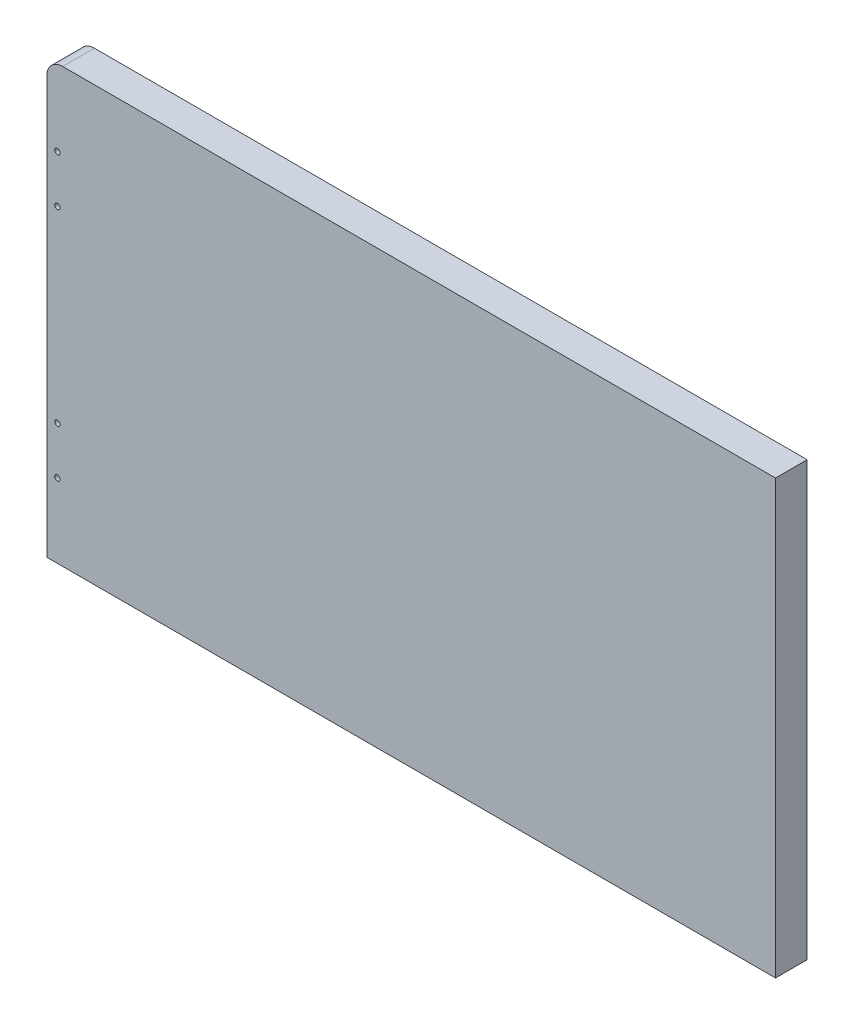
ISO-10303-21;
HEADER;
FILE_DESCRIPTION(('STEP AP214'),'2;1');
FILE_NAME('part.step','',(''),(''),'','','');
FILE_SCHEMA(('AUTOMOTIVE_DESIGN { 1 0 10303 214 1 1 1 1 }'));
ENDSEC;
DATA;
#1=APPLICATION_CONTEXT('core data for automotive mechanical design processes');
#2=APPLICATION_PROTOCOL_DEFINITION('international standard','automotive_design',2000,#1);
#3=PRODUCT_CONTEXT('',#1,'mechanical');
#4=PRODUCT('Part','Part','',(#3));
#5=PRODUCT_RELATED_PRODUCT_CATEGORY('part','',(#4));
#6=PRODUCT_DEFINITION_FORMATION('','',#4);
#7=PRODUCT_DEFINITION_CONTEXT('part definition',#1,'design');
#8=PRODUCT_DEFINITION('design','',#6,#7);
#9=PRODUCT_DEFINITION_SHAPE('','',#8);
#10=(LENGTH_UNIT() NAMED_UNIT(*) SI_UNIT(.MILLI.,.METRE.));
#11=(NAMED_UNIT(*) PLANE_ANGLE_UNIT() SI_UNIT($,.RADIAN.));
#12=(NAMED_UNIT(*) SI_UNIT($,.STERADIAN.) SOLID_ANGLE_UNIT());
#13=UNCERTAINTY_MEASURE_WITH_UNIT(LENGTH_MEASURE(1.E-05),#10,'distance_accuracy_value','');
#14=(GEOMETRIC_REPRESENTATION_CONTEXT(3) GLOBAL_UNCERTAINTY_ASSIGNED_CONTEXT((#13)) GLOBAL_UNIT_ASSIGNED_CONTEXT((#10,
#11,#12)) REPRESENTATION_CONTEXT('',''));
#15=CARTESIAN_POINT('',(0.,0.,0.));
#16=DIRECTION('',(0.,0.,1.));
#17=DIRECTION('',(1.,0.,0.));
#18=AXIS2_PLACEMENT_3D('',#15,#16,#17);
#19=CARTESIAN_POINT('',(690.,410.,60.));
#20=DIRECTION('',(-1.,0.,0.));
#21=DIRECTION('',(0.,-1.,0.));
#22=AXIS2_PLACEMENT_3D('',#19,#20,#21);
#23=PLANE('',#22);
#24=DIRECTION('',(0.,1.,0.));
#25=VECTOR('',#24,1.);
#26=CARTESIAN_POINT('',(690.,410.,0.));
#27=LINE('',#26,#25);
#28=CARTESIAN_POINT('',(690.,-410.,0.));
#29=VERTEX_POINT('',#28);
#30=CARTESIAN_POINT('',(690.,410.,0.));
#31=VERTEX_POINT('',#30);
#32=EDGE_CURVE('E99',#29,#31,#27,.T.);
#33=ORIENTED_EDGE('',*,*,#32,.T.);
#34=DIRECTION('',(0.,0.,-1.));
#35=VECTOR('',#34,1.);
#36=CARTESIAN_POINT('',(690.,410.,60.));
#37=LINE('',#36,#35);
#38=CARTESIAN_POINT('',(690.,410.,60.));
#39=VERTEX_POINT('',#38);
#40=EDGE_CURVE('E82',#39,#31,#37,.T.);
#41=ORIENTED_EDGE('',*,*,#40,.F.);
#42=DIRECTION('',(0.,1.,0.));
#43=VECTOR('',#42,1.);
#44=CARTESIAN_POINT('',(690.,410.,60.));
#45=LINE('',#44,#43);
#46=CARTESIAN_POINT('',(690.,-410.,60.));
#47=VERTEX_POINT('',#46);
#48=EDGE_CURVE('E87',#47,#39,#45,.T.);
#49=ORIENTED_EDGE('',*,*,#48,.F.);
#50=DIRECTION('',(0.,0.,-1.));
#51=VECTOR('',#50,1.);
#52=CARTESIAN_POINT('',(690.,-410.,60.));
#53=LINE('',#52,#51);
#54=EDGE_CURVE('E106',#47,#29,#53,.T.);
#55=ORIENTED_EDGE('',*,*,#54,.T.);
#56=EDGE_LOOP('',(#33,#41,#49,#55));
#57=FACE_BOUND('',#56,.T.);
#58=ADVANCED_FACE('F35',(#57),#23,.F.);
#59=CARTESIAN_POINT('',(-690.,410.,60.));
#60=DIRECTION('',(0.,-1.,0.));
#61=DIRECTION('',(0.,0.,-1.));
#62=AXIS2_PLACEMENT_3D('',#59,#60,#61);
#63=PLANE('',#62);
#64=DIRECTION('',(-1.,0.,0.));
#65=VECTOR('',#64,1.);
#66=CARTESIAN_POINT('',(-690.,410.,0.));
#67=LINE('',#66,#65);
#68=CARTESIAN_POINT('',(-660.,410.,0.));
#69=VERTEX_POINT('',#68);
#70=EDGE_CURVE('E114',#31,#69,#67,.T.);
#71=ORIENTED_EDGE('',*,*,#70,.T.);
#72=DIRECTION('',(0.,0.,-1.));
#73=VECTOR('',#72,1.);
#74=CARTESIAN_POINT('',(-660.,410.,60.));
#75=LINE('',#74,#73);
#76=CARTESIAN_POINT('',(-660.,410.,60.));
#77=VERTEX_POINT('',#76);
#78=EDGE_CURVE('E43',#69,#77,#75,.F.);
#79=ORIENTED_EDGE('',*,*,#78,.T.);
#80=DIRECTION('',(-1.,0.,0.));
#81=VECTOR('',#80,1.);
#82=CARTESIAN_POINT('',(-690.,410.,60.));
#83=LINE('',#82,#81);
#84=EDGE_CURVE('E78',#39,#77,#83,.T.);
#85=ORIENTED_EDGE('',*,*,#84,.F.);
#86=ORIENTED_EDGE('',*,*,#40,.T.);
#87=EDGE_LOOP('',(#71,#79,#85,#86));
#88=FACE_BOUND('',#87,.T.);
#89=ADVANCED_FACE('F80',(#88),#63,.F.);
#90=CARTESIAN_POINT('',(-690.,410.,60.));
#91=DIRECTION('',(1.,0.,0.));
#92=DIRECTION('',(0.,1.,0.));
#93=AXIS2_PLACEMENT_3D('',#90,#91,#92);
#94=PLANE('',#93);
#95=DIRECTION('',(0.,-1.,0.));
#96=VECTOR('',#95,1.);
#97=CARTESIAN_POINT('',(-690.,410.,60.));
#98=LINE('',#97,#96);
#99=CARTESIAN_POINT('',(-690.,380.,60.));
#100=VERTEX_POINT('',#99);
#101=CARTESIAN_POINT('',(-690.,-410.,60.));
#102=VERTEX_POINT('',#101);
#103=EDGE_CURVE('E86',#100,#102,#98,.T.);
#104=ORIENTED_EDGE('',*,*,#103,.F.);
#105=DIRECTION('',(0.,0.,-1.));
#106=VECTOR('',#105,1.);
#107=CARTESIAN_POINT('',(-690.,380.,60.));
#108=LINE('',#107,#106);
#109=CARTESIAN_POINT('',(-690.,380.,0.));
#110=VERTEX_POINT('',#109);
#111=EDGE_CURVE('E100',#100,#110,#108,.T.);
#112=ORIENTED_EDGE('',*,*,#111,.T.);
#113=DIRECTION('',(0.,-1.,0.));
#114=VECTOR('',#113,1.);
#115=CARTESIAN_POINT('',(-690.,410.,0.));
#116=LINE('',#115,#114);
#117=CARTESIAN_POINT('',(-690.,-410.,0.));
#118=VERTEX_POINT('',#117);
#119=EDGE_CURVE('E112',#110,#118,#116,.T.);
#120=ORIENTED_EDGE('',*,*,#119,.T.);
#121=DIRECTION('',(0.,0.,-1.));
#122=VECTOR('',#121,1.);
#123=CARTESIAN_POINT('',(-690.,-410.,60.));
#124=LINE('',#123,#122);
#125=EDGE_CURVE('E101',#102,#118,#124,.T.);
#126=ORIENTED_EDGE('',*,*,#125,.F.);
#127=EDGE_LOOP('',(#104,#112,#120,#126));
#128=FACE_BOUND('',#127,.T.);
#129=ADVANCED_FACE('F183',(#128),#94,.F.);
#130=CARTESIAN_POINT('',(-690.,-410.,60.));
#131=DIRECTION('',(0.,1.,0.));
#132=DIRECTION('',(0.,0.,1.));
#133=AXIS2_PLACEMENT_3D('',#130,#131,#132);
#134=PLANE('',#133);
#135=DIRECTION('',(1.,0.,0.));
#136=VECTOR('',#135,1.);
#137=CARTESIAN_POINT('',(-690.,-410.,0.));
#138=LINE('',#137,#136);
#139=EDGE_CURVE('E96',#118,#29,#138,.T.);
#140=ORIENTED_EDGE('',*,*,#139,.T.);
#141=ORIENTED_EDGE('',*,*,#54,.F.);
#142=DIRECTION('',(1.,0.,0.));
#143=VECTOR('',#142,1.);
#144=CARTESIAN_POINT('',(-690.,-410.,60.));
#145=LINE('',#144,#143);
#146=EDGE_CURVE('E92',#102,#47,#145,.T.);
#147=ORIENTED_EDGE('',*,*,#146,.F.);
#148=ORIENTED_EDGE('',*,*,#125,.T.);
#149=EDGE_LOOP('',(#140,#141,#147,#148));
#150=FACE_BOUND('',#149,.T.);
#151=ADVANCED_FACE('F156',(#150),#134,.F.);
#152=CARTESIAN_POINT('',(0.,0.,60.));
#153=DIRECTION('',(0.,0.,1.));
#154=DIRECTION('',(1.,0.,0.));
#155=AXIS2_PLACEMENT_3D('',#152,#153,#154);
#156=PLANE('',#155);
#157=CARTESIAN_POINT('',(-670.,265.440772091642,60.));
#158=DIRECTION('',(0.,0.,1.));
#159=DIRECTION('',(1.,0.,0.));
#160=AXIS2_PLACEMENT_3D('',#157,#158,#159);
#161=CIRCLE('',#160,5.00000000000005);
#162=CARTESIAN_POINT('',(-665.,265.440772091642,60.));
#163=VERTEX_POINT('',#162);
#164=EDGE_CURVE('E133',#163,#163,#161,.T.);
#165=ORIENTED_EDGE('',*,*,#164,.F.);
#166=EDGE_LOOP('',(#165));
#167=FACE_BOUND('',#166,.T.);
#168=CARTESIAN_POINT('',(-669.930940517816,-180.000026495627,60.));
#169=DIRECTION('',(0.,0.,1.));
#170=DIRECTION('',(1.,0.,0.));
#171=AXIS2_PLACEMENT_3D('',#168,#169,#170);
#172=CIRCLE('',#171,5.00000000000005);
#173=CARTESIAN_POINT('',(-664.930940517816,-180.000026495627,60.));
#174=VERTEX_POINT('',#173);
#175=EDGE_CURVE('E134',#174,#174,#172,.T.);
#176=ORIENTED_EDGE('',*,*,#175,.F.);
#177=EDGE_LOOP('',(#176));
#178=FACE_BOUND('',#177,.T.);
#179=CARTESIAN_POINT('',(-670.,-270.,60.));
#180=DIRECTION('',(0.,0.,1.));
#181=DIRECTION('',(1.,0.,0.));
#182=AXIS2_PLACEMENT_3D('',#179,#180,#181);
#183=CIRCLE('',#182,5.00000000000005);
#184=CARTESIAN_POINT('',(-665.,-270.,60.));
#185=VERTEX_POINT('',#184);
#186=EDGE_CURVE('E120',#185,#185,#183,.T.);
#187=ORIENTED_EDGE('',*,*,#186,.F.);
#188=EDGE_LOOP('',(#187));
#189=FACE_BOUND('',#188,.T.);
#190=CARTESIAN_POINT('',(-670.,175.317645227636,60.));
#191=DIRECTION('',(0.,0.,1.));
#192=DIRECTION('',(1.,0.,0.));
#193=AXIS2_PLACEMENT_3D('',#190,#191,#192);
#194=CIRCLE('',#193,5.00000000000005);
#195=CARTESIAN_POINT('',(-665.,175.317645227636,60.));
#196=VERTEX_POINT('',#195);
#197=EDGE_CURVE('E127',#196,#196,#194,.T.);
#198=ORIENTED_EDGE('',*,*,#197,.F.);
#199=EDGE_LOOP('',(#198));
#200=FACE_BOUND('',#199,.T.);
#201=ORIENTED_EDGE('',*,*,#84,.T.);
#202=CARTESIAN_POINT('',(-660.,380.,60.));
#203=DIRECTION('',(0.,0.,1.));
#204=DIRECTION('',(1.,0.,0.));
#205=AXIS2_PLACEMENT_3D('',#202,#203,#204);
#206=CIRCLE('',#205,30.);
#207=EDGE_CURVE('E11',#77,#100,#206,.T.);
#208=ORIENTED_EDGE('',*,*,#207,.T.);
#209=ORIENTED_EDGE('',*,*,#103,.T.);
#210=ORIENTED_EDGE('',*,*,#146,.T.);
#211=ORIENTED_EDGE('',*,*,#48,.T.);
#212=EDGE_LOOP('',(#201,#208,#209,#210,#211));
#213=FACE_BOUND('',#212,.T.);
#214=ADVANCED_FACE('F90',(#167,#178,#189,#200,#213),#156,.T.);
#215=CARTESIAN_POINT('',(0.,0.,0.));
#216=DIRECTION('',(0.,0.,1.));
#217=DIRECTION('',(1.,0.,0.));
#218=AXIS2_PLACEMENT_3D('',#215,#216,#217);
#219=PLANE('',#218);
#220=ORIENTED_EDGE('',*,*,#119,.F.);
#221=CARTESIAN_POINT('',(-660.,380.,0.));
#222=DIRECTION('',(0.,0.,1.));
#223=DIRECTION('',(1.,0.,0.));
#224=AXIS2_PLACEMENT_3D('',#221,#222,#223);
#225=CIRCLE('',#224,30.);
#226=EDGE_CURVE('E57',#110,#69,#225,.F.);
#227=ORIENTED_EDGE('',*,*,#226,.T.);
#228=ORIENTED_EDGE('',*,*,#70,.F.);
#229=ORIENTED_EDGE('',*,*,#32,.F.);
#230=ORIENTED_EDGE('',*,*,#139,.F.);
#231=EDGE_LOOP('',(#220,#227,#228,#229,#230));
#232=FACE_BOUND('',#231,.T.);
#233=ADVANCED_FACE('F155',(#232),#219,.F.);
#234=CARTESIAN_POINT('',(-660.,380.,60.));
#235=DIRECTION('',(0.,0.,-1.));
#236=DIRECTION('',(-1.,0.,0.));
#237=AXIS2_PLACEMENT_3D('',#234,#235,#236);
#238=CYLINDRICAL_SURFACE('',#237,30.);
#239=ORIENTED_EDGE('',*,*,#207,.F.);
#240=ORIENTED_EDGE('',*,*,#78,.F.);
#241=ORIENTED_EDGE('',*,*,#226,.F.);
#242=ORIENTED_EDGE('',*,*,#111,.F.);
#243=EDGE_LOOP('',(#239,#240,#241,#242));
#244=FACE_BOUND('',#243,.T.);
#245=ADVANCED_FACE('F37',(#244),#238,.T.);
#246=CARTESIAN_POINT('',(-670.,175.317645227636,50.));
#247=DIRECTION('',(0.,0.,1.));
#248=DIRECTION('',(1.,0.,0.));
#249=AXIS2_PLACEMENT_3D('',#246,#247,#248);
#250=CYLINDRICAL_SURFACE('',#249,5.00000000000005);
#251=CARTESIAN_POINT('',(-670.,175.317645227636,50.));
#252=DIRECTION('',(0.,0.,1.));
#253=DIRECTION('',(1.,0.,0.));
#254=AXIS2_PLACEMENT_3D('',#251,#252,#253);
#255=CIRCLE('',#254,5.00000000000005);
#256=CARTESIAN_POINT('',(-665.,175.317645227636,50.));
#257=VERTEX_POINT('',#256);
#258=EDGE_CURVE('E130',#257,#257,#255,.T.);
#259=ORIENTED_EDGE('',*,*,#258,.F.);
#260=EDGE_LOOP('',(#259));
#261=FACE_BOUND('',#260,.T.);
#262=ORIENTED_EDGE('',*,*,#197,.T.);
#263=EDGE_LOOP('',(#262));
#264=FACE_BOUND('',#263,.T.);
#265=ADVANCED_FACE('F164',(#261,#264),#250,.F.);
#266=CARTESIAN_POINT('',(-670.,175.317645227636,50.));
#267=DIRECTION('',(0.,0.,1.));
#268=DIRECTION('',(1.,0.,0.));
#269=AXIS2_PLACEMENT_3D('',#266,#267,#268);
#270=PLANE('',#269);
#271=ORIENTED_EDGE('',*,*,#258,.T.);
#272=EDGE_LOOP('',(#271));
#273=FACE_BOUND('',#272,.T.);
#274=ADVANCED_FACE('F166',(#273),#270,.T.);
#275=CARTESIAN_POINT('',(-670.,-270.,50.));
#276=DIRECTION('',(0.,0.,1.));
#277=DIRECTION('',(1.,0.,0.));
#278=AXIS2_PLACEMENT_3D('',#275,#276,#277);
#279=CYLINDRICAL_SURFACE('',#278,5.00000000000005);
#280=CARTESIAN_POINT('',(-670.,-270.,50.));
#281=DIRECTION('',(0.,0.,1.));
#282=DIRECTION('',(1.,0.,0.));
#283=AXIS2_PLACEMENT_3D('',#280,#281,#282);
#284=CIRCLE('',#283,5.00000000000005);
#285=CARTESIAN_POINT('',(-665.,-270.,50.));
#286=VERTEX_POINT('',#285);
#287=EDGE_CURVE('E123',#286,#286,#284,.T.);
#288=ORIENTED_EDGE('',*,*,#287,.F.);
#289=EDGE_LOOP('',(#288));
#290=FACE_BOUND('',#289,.T.);
#291=ORIENTED_EDGE('',*,*,#186,.T.);
#292=EDGE_LOOP('',(#291));
#293=FACE_BOUND('',#292,.T.);
#294=ADVANCED_FACE('F173',(#290,#293),#279,.F.);
#295=CARTESIAN_POINT('',(-670.,-270.,50.));
#296=DIRECTION('',(0.,0.,1.));
#297=DIRECTION('',(1.,0.,0.));
#298=AXIS2_PLACEMENT_3D('',#295,#296,#297);
#299=PLANE('',#298);
#300=ORIENTED_EDGE('',*,*,#287,.T.);
#301=EDGE_LOOP('',(#300));
#302=FACE_BOUND('',#301,.T.);
#303=ADVANCED_FACE('F195',(#302),#299,.T.);
#304=CARTESIAN_POINT('',(-669.930940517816,-180.000026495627,50.));
#305=DIRECTION('',(0.,0.,1.));
#306=DIRECTION('',(1.,0.,0.));
#307=AXIS2_PLACEMENT_3D('',#304,#305,#306);
#308=CYLINDRICAL_SURFACE('',#307,5.00000000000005);
#309=CARTESIAN_POINT('',(-669.930940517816,-180.000026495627,50.));
#310=DIRECTION('',(0.,0.,1.));
#311=DIRECTION('',(1.,0.,0.));
#312=AXIS2_PLACEMENT_3D('',#309,#310,#311);
#313=CIRCLE('',#312,5.00000000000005);
#314=CARTESIAN_POINT('',(-664.930940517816,-180.000026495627,50.));
#315=VERTEX_POINT('',#314);
#316=EDGE_CURVE('E124',#315,#315,#313,.T.);
#317=ORIENTED_EDGE('',*,*,#316,.F.);
#318=EDGE_LOOP('',(#317));
#319=FACE_BOUND('',#318,.T.);
#320=ORIENTED_EDGE('',*,*,#175,.T.);
#321=EDGE_LOOP('',(#320));
#322=FACE_BOUND('',#321,.T.);
#323=ADVANCED_FACE('F198',(#319,#322),#308,.F.);
#324=CARTESIAN_POINT('',(-669.930940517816,-180.000026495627,50.));
#325=DIRECTION('',(0.,0.,1.));
#326=DIRECTION('',(1.,0.,0.));
#327=AXIS2_PLACEMENT_3D('',#324,#325,#326);
#328=PLANE('',#327);
#329=ORIENTED_EDGE('',*,*,#316,.T.);
#330=EDGE_LOOP('',(#329));
#331=FACE_BOUND('',#330,.T.);
#332=ADVANCED_FACE('F149',(#331),#328,.T.);
#333=CARTESIAN_POINT('',(-670.,265.440772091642,50.));
#334=DIRECTION('',(0.,0.,1.));
#335=DIRECTION('',(1.,0.,0.));
#336=AXIS2_PLACEMENT_3D('',#333,#334,#335);
#337=CYLINDRICAL_SURFACE('',#336,5.00000000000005);
#338=CARTESIAN_POINT('',(-670.,265.440772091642,50.));
#339=DIRECTION('',(0.,0.,1.));
#340=DIRECTION('',(1.,0.,0.));
#341=AXIS2_PLACEMENT_3D('',#338,#339,#340);
#342=CIRCLE('',#341,5.00000000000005);
#343=CARTESIAN_POINT('',(-665.,265.440772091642,50.));
#344=VERTEX_POINT('',#343);
#345=EDGE_CURVE('E117',#344,#344,#342,.T.);
#346=ORIENTED_EDGE('',*,*,#345,.F.);
#347=EDGE_LOOP('',(#346));
#348=FACE_BOUND('',#347,.T.);
#349=ORIENTED_EDGE('',*,*,#164,.T.);
#350=EDGE_LOOP('',(#349));
#351=FACE_BOUND('',#350,.T.);
#352=ADVANCED_FACE('F146',(#348,#351),#337,.F.);
#353=CARTESIAN_POINT('',(-670.,265.440772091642,50.));
#354=DIRECTION('',(0.,0.,1.));
#355=DIRECTION('',(1.,0.,0.));
#356=AXIS2_PLACEMENT_3D('',#353,#354,#355);
#357=PLANE('',#356);
#358=ORIENTED_EDGE('',*,*,#345,.T.);
#359=EDGE_LOOP('',(#358));
#360=FACE_BOUND('',#359,.T.);
#361=ADVANCED_FACE('F144',(#360),#357,.T.);
#362=CLOSED_SHELL('',(#58,#89,#129,#151,#214,#233,#245,#265,#274,#294,#303,#323,#332,#352,#361));
#363=MANIFOLD_SOLID_BREP('B2',#362);
#364=ADVANCED_BREP_SHAPE_REPRESENTATION('',(#18,#363),#14);
#365=SHAPE_DEFINITION_REPRESENTATION(#9,#364);
ENDSEC;
END-ISO-10303-21;
